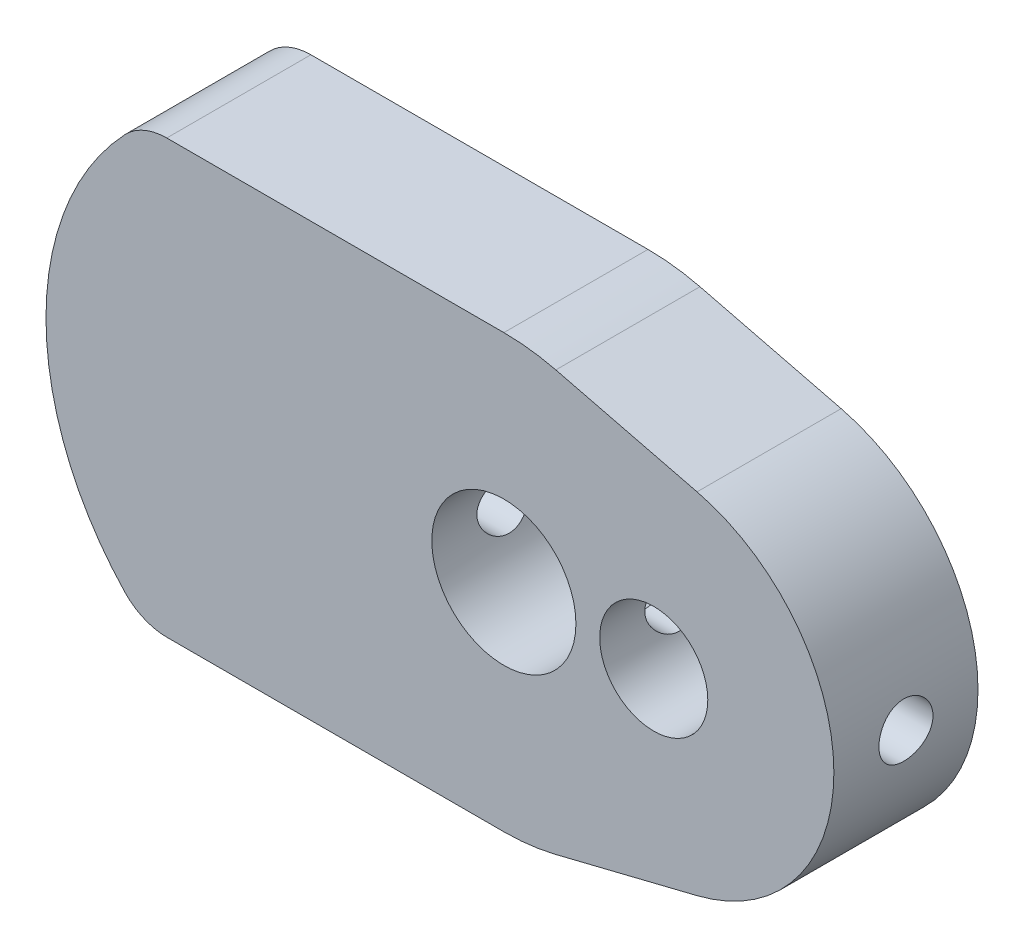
ISO-10303-21;
HEADER;
FILE_DESCRIPTION(('STEP AP214'),'2;1');
FILE_NAME('part.step','',(''),(''),'','','');
FILE_SCHEMA(('AUTOMOTIVE_DESIGN { 1 0 10303 214 1 1 1 1 }'));
ENDSEC;
DATA;
#1=APPLICATION_CONTEXT('core data for automotive mechanical design processes');
#2=APPLICATION_PROTOCOL_DEFINITION('international standard','automotive_design',2000,#1);
#3=PRODUCT_CONTEXT('',#1,'mechanical');
#4=PRODUCT('Part','Part','',(#3));
#5=PRODUCT_RELATED_PRODUCT_CATEGORY('part','',(#4));
#6=PRODUCT_DEFINITION_FORMATION('','',#4);
#7=PRODUCT_DEFINITION_CONTEXT('part definition',#1,'design');
#8=PRODUCT_DEFINITION('design','',#6,#7);
#9=PRODUCT_DEFINITION_SHAPE('','',#8);
#10=(LENGTH_UNIT() NAMED_UNIT(*) SI_UNIT(.MILLI.,.METRE.));
#11=(NAMED_UNIT(*) PLANE_ANGLE_UNIT() SI_UNIT($,.RADIAN.));
#12=(NAMED_UNIT(*) SI_UNIT($,.STERADIAN.) SOLID_ANGLE_UNIT());
#13=UNCERTAINTY_MEASURE_WITH_UNIT(LENGTH_MEASURE(1.E-05),#10,'distance_accuracy_value','');
#14=(GEOMETRIC_REPRESENTATION_CONTEXT(3) GLOBAL_UNCERTAINTY_ASSIGNED_CONTEXT((#13)) GLOBAL_UNIT_ASSIGNED_CONTEXT((#10,
#11,#12)) REPRESENTATION_CONTEXT('',''));
#15=CARTESIAN_POINT('',(0.,0.,0.));
#16=DIRECTION('',(0.,0.,1.));
#17=DIRECTION('',(1.,0.,0.));
#18=AXIS2_PLACEMENT_3D('',#15,#16,#17);
#19=CARTESIAN_POINT('',(0.,0.,3.175));
#20=DIRECTION('',(0.,0.,-1.));
#21=DIRECTION('',(-1.,0.,0.));
#22=AXIS2_PLACEMENT_3D('',#19,#20,#21);
#23=CYLINDRICAL_SURFACE('',#22,9.525);
#24=DIRECTION('',(0.,0.,1.));
#25=VECTOR('',#24,1.);
#26=CARTESIAN_POINT('',(0.,9.52500000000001,-30.9224794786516));
#27=LINE('',#26,#25);
#28=CARTESIAN_POINT('',(0.,9.52500000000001,-3.175));
#29=VERTEX_POINT('',#28);
#30=CARTESIAN_POINT('',(0.,9.52500000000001,3.175));
#31=VERTEX_POINT('',#30);
#32=EDGE_CURVE('E63',#29,#31,#27,.T.);
#33=ORIENTED_EDGE('',*,*,#32,.T.);
#34=CARTESIAN_POINT('',(0.,0.,3.175));
#35=DIRECTION('',(0.,0.,1.));
#36=DIRECTION('',(1.,0.,0.));
#37=AXIS2_PLACEMENT_3D('',#34,#35,#36);
#38=CIRCLE('',#37,9.525);
#39=CARTESIAN_POINT('',(2.28966346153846,9.24570528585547,3.175));
#40=VERTEX_POINT('',#39);
#41=EDGE_CURVE('E182',#40,#31,#38,.T.);
#42=ORIENTED_EDGE('',*,*,#41,.F.);
#43=DIRECTION('',(0.,0.,-1.));
#44=VECTOR('',#43,1.);
#45=CARTESIAN_POINT('',(2.28966346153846,9.24570528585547,3.175));
#46=LINE('',#45,#44);
#47=CARTESIAN_POINT('',(2.28966346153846,9.24570528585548,-3.175));
#48=VERTEX_POINT('',#47);
#49=EDGE_CURVE('E190',#40,#48,#46,.T.);
#50=ORIENTED_EDGE('',*,*,#49,.T.);
#51=CARTESIAN_POINT('',(0.,0.,-3.175));
#52=DIRECTION('',(0.,0.,1.));
#53=DIRECTION('',(1.,0.,0.));
#54=AXIS2_PLACEMENT_3D('',#51,#52,#53);
#55=CIRCLE('',#54,9.525);
#56=EDGE_CURVE('E191',#48,#29,#55,.T.);
#57=ORIENTED_EDGE('',*,*,#56,.T.);
#58=EDGE_LOOP('',(#33,#42,#50,#57));
#59=FACE_BOUND('',#58,.T.);
#60=ADVANCED_FACE('F36',(#59),#23,.T.);
#61=CARTESIAN_POINT('',(0.,0.,3.175));
#62=DIRECTION('',(0.,0.,1.));
#63=DIRECTION('',(1.,0.,0.));
#64=AXIS2_PLACEMENT_3D('',#61,#62,#63);
#65=PLANE('',#64);
#66=CARTESIAN_POINT('',(0.,0.,3.175));
#67=DIRECTION('',(0.,0.,1.));
#68=DIRECTION('',(1.,0.,0.));
#69=AXIS2_PLACEMENT_3D('',#66,#67,#68);
#70=CIRCLE('',#69,3.175);
#71=CARTESIAN_POINT('',(3.175,0.,3.175));
#72=VERTEX_POINT('',#71);
#73=EDGE_CURVE('E176',#72,#72,#70,.T.);
#74=ORIENTED_EDGE('',*,*,#73,.F.);
#75=EDGE_LOOP('',(#74));
#76=FACE_BOUND('',#75,.T.);
#77=ORIENTED_EDGE('',*,*,#41,.T.);
#78=DIRECTION('',(-1.,0.,0.));
#79=VECTOR('',#78,1.);
#80=CARTESIAN_POINT('',(0.,9.52500000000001,3.175));
#81=LINE('',#80,#79);
#82=CARTESIAN_POINT('',(-14.8527728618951,9.52500000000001,3.175));
#83=VERTEX_POINT('',#82);
#84=EDGE_CURVE('E131',#31,#83,#81,.T.);
#85=ORIENTED_EDGE('',*,*,#84,.T.);
#86=CARTESIAN_POINT('',(-14.8527728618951,6.985,3.175));
#87=DIRECTION('',(0.,0.,1.));
#88=DIRECTION('',(1.,0.,0.));
#89=AXIS2_PLACEMENT_3D('',#86,#87,#88);
#90=CIRCLE('',#89,2.54);
#91=CARTESIAN_POINT('',(-16.6972811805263,8.73125,3.175));
#92=VERTEX_POINT('',#91);
#93=EDGE_CURVE('E125',#83,#92,#90,.T.);
#94=ORIENTED_EDGE('',*,*,#93,.T.);
#95=CARTESIAN_POINT('',(-7.47473958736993,0.,3.175));
#96=DIRECTION('',(0.,0.,1.));
#97=DIRECTION('',(1.,0.,0.));
#98=AXIS2_PLACEMENT_3D('',#95,#96,#97);
#99=CIRCLE('',#98,12.7);
#100=CARTESIAN_POINT('',(-16.6972811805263,-8.73125,3.175));
#101=VERTEX_POINT('',#100);
#102=EDGE_CURVE('E134',#92,#101,#99,.T.);
#103=ORIENTED_EDGE('',*,*,#102,.T.);
#104=CARTESIAN_POINT('',(-14.8527728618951,-6.98500000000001,3.175));
#105=DIRECTION('',(0.,0.,1.));
#106=DIRECTION('',(-1.,0.,0.));
#107=AXIS2_PLACEMENT_3D('',#104,#105,#106);
#108=CIRCLE('',#107,2.54);
#109=CARTESIAN_POINT('',(-14.8527728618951,-9.52500000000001,3.175));
#110=VERTEX_POINT('',#109);
#111=EDGE_CURVE('E140',#101,#110,#108,.T.);
#112=ORIENTED_EDGE('',*,*,#111,.T.);
#113=DIRECTION('',(1.,0.,0.));
#114=VECTOR('',#113,1.);
#115=CARTESIAN_POINT('',(0.,-9.52500000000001,3.175));
#116=LINE('',#115,#114);
#117=CARTESIAN_POINT('',(0.,-9.52500000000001,3.175));
#118=VERTEX_POINT('',#117);
#119=EDGE_CURVE('E154',#110,#118,#116,.T.);
#120=ORIENTED_EDGE('',*,*,#119,.T.);
#121=CARTESIAN_POINT('',(2.28966346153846,-9.24570528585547,3.175));
#122=VERTEX_POINT('',#121);
#123=EDGE_CURVE('E55',#118,#122,#38,.T.);
#124=ORIENTED_EDGE('',*,*,#123,.T.);
#125=DIRECTION('',(0.970677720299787,0.240384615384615,0.));
#126=VECTOR('',#125,1.);
#127=CARTESIAN_POINT('',(2.28966346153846,-9.24570528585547,3.175));
#128=LINE('',#127,#126);
#129=CARTESIAN_POINT('',(8.51205288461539,-7.70475440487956,3.175));
#130=VERTEX_POINT('',#129);
#131=EDGE_CURVE('E184',#122,#130,#128,.T.);
#132=ORIENTED_EDGE('',*,*,#131,.T.);
#133=CARTESIAN_POINT('',(6.604,0.,3.175));
#134=DIRECTION('',(0.,0.,1.));
#135=DIRECTION('',(1.,0.,0.));
#136=AXIS2_PLACEMENT_3D('',#133,#134,#135);
#137=CIRCLE('',#136,7.9375);
#138=CARTESIAN_POINT('',(8.51205288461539,7.70475440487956,3.175));
#139=VERTEX_POINT('',#138);
#140=EDGE_CURVE('E186',#130,#139,#137,.T.);
#141=ORIENTED_EDGE('',*,*,#140,.T.);
#142=DIRECTION('',(-0.970677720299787,0.240384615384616,0.));
#143=VECTOR('',#142,1.);
#144=CARTESIAN_POINT('',(2.28966346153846,9.24570528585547,3.175));
#145=LINE('',#144,#143);
#146=EDGE_CURVE('E188',#139,#40,#145,.T.);
#147=ORIENTED_EDGE('',*,*,#146,.T.);
#148=EDGE_LOOP('',(#77,#85,#94,#103,#112,#120,#124,#132,#141,#147));
#149=FACE_BOUND('',#148,.T.);
#150=CARTESIAN_POINT('',(6.604,0.,3.175));
#151=DIRECTION('',(0.,0.,1.));
#152=DIRECTION('',(1.,0.,0.));
#153=AXIS2_PLACEMENT_3D('',#150,#151,#152);
#154=CIRCLE('',#153,2.38125);
#155=CARTESIAN_POINT('',(8.98525000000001,0.,3.175));
#156=VERTEX_POINT('',#155);
#157=EDGE_CURVE('E170',#156,#156,#154,.T.);
#158=ORIENTED_EDGE('',*,*,#157,.F.);
#159=EDGE_LOOP('',(#158));
#160=FACE_BOUND('',#159,.T.);
#161=ADVANCED_FACE('F142',(#76,#149,#160),#65,.T.);
#162=CARTESIAN_POINT('',(0.,0.,-3.175));
#163=DIRECTION('',(0.,0.,1.));
#164=DIRECTION('',(1.,0.,0.));
#165=AXIS2_PLACEMENT_3D('',#162,#163,#164);
#166=PLANE('',#165);
#167=CARTESIAN_POINT('',(0.,0.,-3.175));
#168=DIRECTION('',(0.,0.,1.));
#169=DIRECTION('',(1.,0.,0.));
#170=AXIS2_PLACEMENT_3D('',#167,#168,#169);
#171=CIRCLE('',#170,3.175);
#172=CARTESIAN_POINT('',(3.175,0.,-3.175));
#173=VERTEX_POINT('',#172);
#174=EDGE_CURVE('E173',#173,#173,#171,.T.);
#175=ORIENTED_EDGE('',*,*,#174,.T.);
#176=EDGE_LOOP('',(#175));
#177=FACE_BOUND('',#176,.T.);
#178=ORIENTED_EDGE('',*,*,#56,.F.);
#179=DIRECTION('',(-0.970677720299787,0.240384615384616,0.));
#180=VECTOR('',#179,1.);
#181=CARTESIAN_POINT('',(2.28966346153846,9.24570528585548,-3.175));
#182=LINE('',#181,#180);
#183=CARTESIAN_POINT('',(8.51205288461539,7.70475440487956,-3.175));
#184=VERTEX_POINT('',#183);
#185=EDGE_CURVE('E197',#184,#48,#182,.T.);
#186=ORIENTED_EDGE('',*,*,#185,.F.);
#187=CARTESIAN_POINT('',(6.604,0.,-3.175));
#188=DIRECTION('',(0.,0.,1.));
#189=DIRECTION('',(1.,0.,0.));
#190=AXIS2_PLACEMENT_3D('',#187,#188,#189);
#191=CIRCLE('',#190,7.9375);
#192=CARTESIAN_POINT('',(8.51205288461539,-7.70475440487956,-3.175));
#193=VERTEX_POINT('',#192);
#194=EDGE_CURVE('E195',#193,#184,#191,.T.);
#195=ORIENTED_EDGE('',*,*,#194,.F.);
#196=DIRECTION('',(0.970677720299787,0.240384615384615,0.));
#197=VECTOR('',#196,1.);
#198=CARTESIAN_POINT('',(2.28966346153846,-9.24570528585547,-3.175));
#199=LINE('',#198,#197);
#200=CARTESIAN_POINT('',(2.28966346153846,-9.24570528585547,-3.175));
#201=VERTEX_POINT('',#200);
#202=EDGE_CURVE('E193',#201,#193,#199,.T.);
#203=ORIENTED_EDGE('',*,*,#202,.F.);
#204=CARTESIAN_POINT('',(0.,-9.52500000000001,-3.175));
#205=VERTEX_POINT('',#204);
#206=EDGE_CURVE('E179',#205,#201,#55,.T.);
#207=ORIENTED_EDGE('',*,*,#206,.F.);
#208=DIRECTION('',(-1.,0.,0.));
#209=VECTOR('',#208,1.);
#210=CARTESIAN_POINT('',(0.,-9.52500000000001,-3.175));
#211=LINE('',#210,#209);
#212=CARTESIAN_POINT('',(-14.8527728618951,-9.52500000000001,-3.175));
#213=VERTEX_POINT('',#212);
#214=EDGE_CURVE('E231',#205,#213,#211,.T.);
#215=ORIENTED_EDGE('',*,*,#214,.T.);
#216=CARTESIAN_POINT('',(-14.8527728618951,-6.985,-3.175));
#217=DIRECTION('',(0.,0.,1.));
#218=DIRECTION('',(1.,0.,0.));
#219=AXIS2_PLACEMENT_3D('',#216,#217,#218);
#220=CIRCLE('',#219,2.54);
#221=CARTESIAN_POINT('',(-16.6972811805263,-8.73125,-3.175));
#222=VERTEX_POINT('',#221);
#223=EDGE_CURVE('E160',#213,#222,#220,.F.);
#224=ORIENTED_EDGE('',*,*,#223,.T.);
#225=CARTESIAN_POINT('',(-7.47473958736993,0.,-3.175));
#226=DIRECTION('',(0.,0.,1.));
#227=DIRECTION('',(1.,0.,0.));
#228=AXIS2_PLACEMENT_3D('',#225,#226,#227);
#229=CIRCLE('',#228,12.7);
#230=CARTESIAN_POINT('',(-16.6972811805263,8.73125,-3.175));
#231=VERTEX_POINT('',#230);
#232=EDGE_CURVE('E167',#222,#231,#229,.F.);
#233=ORIENTED_EDGE('',*,*,#232,.T.);
#234=CARTESIAN_POINT('',(-14.8527728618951,6.985,-3.175));
#235=DIRECTION('',(0.,0.,1.));
#236=DIRECTION('',(1.,0.,0.));
#237=AXIS2_PLACEMENT_3D('',#234,#235,#236);
#238=CIRCLE('',#237,2.54);
#239=CARTESIAN_POINT('',(-14.8527728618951,9.52500000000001,-3.175));
#240=VERTEX_POINT('',#239);
#241=EDGE_CURVE('E127',#231,#240,#238,.F.);
#242=ORIENTED_EDGE('',*,*,#241,.T.);
#243=DIRECTION('',(1.,0.,0.));
#244=VECTOR('',#243,1.);
#245=CARTESIAN_POINT('',(0.,9.52500000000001,-3.175));
#246=LINE('',#245,#244);
#247=EDGE_CURVE('E233',#240,#29,#246,.T.);
#248=ORIENTED_EDGE('',*,*,#247,.T.);
#249=EDGE_LOOP('',(#178,#186,#195,#203,#207,#215,#224,#233,#242,#248));
#250=FACE_BOUND('',#249,.T.);
#251=CARTESIAN_POINT('',(6.604,0.,-3.175));
#252=DIRECTION('',(0.,0.,1.));
#253=DIRECTION('',(1.,0.,0.));
#254=AXIS2_PLACEMENT_3D('',#251,#252,#253);
#255=CIRCLE('',#254,2.38125);
#256=CARTESIAN_POINT('',(8.98525000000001,0.,-3.175));
#257=VERTEX_POINT('',#256);
#258=EDGE_CURVE('E169',#257,#257,#255,.T.);
#259=ORIENTED_EDGE('',*,*,#258,.T.);
#260=EDGE_LOOP('',(#259));
#261=FACE_BOUND('',#260,.T.);
#262=ADVANCED_FACE('F216',(#177,#250,#261),#166,.F.);
#263=ORIENTED_EDGE('',*,*,#123,.F.);
#264=DIRECTION('',(0.,0.,1.));
#265=VECTOR('',#264,1.);
#266=CARTESIAN_POINT('',(0.,-9.52500000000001,-30.9224794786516));
#267=LINE('',#266,#265);
#268=EDGE_CURVE('E162',#205,#118,#267,.T.);
#269=ORIENTED_EDGE('',*,*,#268,.F.);
#270=ORIENTED_EDGE('',*,*,#206,.T.);
#271=DIRECTION('',(0.,0.,-1.));
#272=VECTOR('',#271,1.);
#273=CARTESIAN_POINT('',(2.28966346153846,-9.24570528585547,3.175));
#274=LINE('',#273,#272);
#275=EDGE_CURVE('E48',#122,#201,#274,.T.);
#276=ORIENTED_EDGE('',*,*,#275,.F.);
#277=EDGE_LOOP('',(#263,#269,#270,#276));
#278=FACE_BOUND('',#277,.T.);
#279=ADVANCED_FACE('F38',(#278),#23,.T.);
#280=CARTESIAN_POINT('',(2.28966346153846,-9.24570528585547,3.175));
#281=DIRECTION('',(-0.240384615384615,0.970677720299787,0.));
#282=DIRECTION('',(-0.970677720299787,-0.240384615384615,0.));
#283=AXIS2_PLACEMENT_3D('',#280,#281,#282);
#284=PLANE('',#283);
#285=ORIENTED_EDGE('',*,*,#202,.T.);
#286=DIRECTION('',(0.,0.,-1.));
#287=VECTOR('',#286,1.);
#288=CARTESIAN_POINT('',(8.51205288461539,-7.70475440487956,3.175));
#289=LINE('',#288,#287);
#290=EDGE_CURVE('E204',#130,#193,#289,.T.);
#291=ORIENTED_EDGE('',*,*,#290,.F.);
#292=ORIENTED_EDGE('',*,*,#131,.F.);
#293=ORIENTED_EDGE('',*,*,#275,.T.);
#294=EDGE_LOOP('',(#285,#291,#292,#293));
#295=FACE_BOUND('',#294,.T.);
#296=ADVANCED_FACE('F209',(#295),#284,.F.);
#297=CARTESIAN_POINT('',(6.604,0.,3.175));
#298=DIRECTION('',(0.,0.,-1.));
#299=DIRECTION('',(-1.,0.,0.));
#300=AXIS2_PLACEMENT_3D('',#297,#298,#299);
#301=CYLINDRICAL_SURFACE('',#300,7.9375);
#302=CARTESIAN_POINT('',(14.5415,0.,-1.190625));
#303=CARTESIAN_POINT('',(14.5414989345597,-0.0664777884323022,-1.19062225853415));
#304=CARTESIAN_POINT('',(14.5406561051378,-0.132994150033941,-1.18503858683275));
#305=CARTESIAN_POINT('',(14.5373750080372,-0.264167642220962,-1.16285708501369));
#306=CARTESIAN_POINT('',(14.5349351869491,-0.328822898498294,-1.14624853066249));
#307=CARTESIAN_POINT('',(14.52873428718,-0.454356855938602,-1.10252469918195));
#308=CARTESIAN_POINT('',(14.5249742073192,-0.515238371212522,-1.07541736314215));
#309=CARTESIAN_POINT('',(14.5165482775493,-0.631579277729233,-1.01148484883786));
#310=CARTESIAN_POINT('',(14.5118825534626,-0.687039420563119,-0.974661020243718));
#311=CARTESIAN_POINT('',(14.5021234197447,-0.791405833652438,-0.892034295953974));
#312=CARTESIAN_POINT('',(14.4970272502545,-0.840263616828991,-0.846170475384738));
#313=CARTESIAN_POINT('',(14.4870031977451,-0.929620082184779,-0.746896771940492));
#314=CARTESIAN_POINT('',(14.4820753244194,-0.970118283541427,-0.69348645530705));
#315=CARTESIAN_POINT('',(14.4729190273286,-1.0417947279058,-0.580310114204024));
#316=CARTESIAN_POINT('',(14.4686941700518,-1.07292605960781,-0.520514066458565));
#317=CARTESIAN_POINT('',(14.4614599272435,-1.12468526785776,-0.396467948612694));
#318=CARTESIAN_POINT('',(14.4584504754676,-1.14531371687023,-0.332218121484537));
#319=CARTESIAN_POINT('',(14.4540149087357,-1.17533101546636,-0.201598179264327));
#320=CARTESIAN_POINT('',(14.4525771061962,-1.18480287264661,-0.135247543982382));
#321=CARTESIAN_POINT('',(14.451412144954,-1.19249526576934,-0.00188423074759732));
#322=CARTESIAN_POINT('',(14.4516848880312,-1.1907164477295,0.0651284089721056));
#323=CARTESIAN_POINT('',(14.4538995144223,-1.17602582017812,0.197327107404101));
#324=CARTESIAN_POINT('',(14.4558275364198,-1.16320646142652,0.262523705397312));
#325=CARTESIAN_POINT('',(14.461113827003,-1.12694336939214,0.389829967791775));
#326=CARTESIAN_POINT('',(14.4644721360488,-1.10349933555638,0.451939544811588));
#327=CARTESIAN_POINT('',(14.4722559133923,-1.04655622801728,0.571589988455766));
#328=CARTESIAN_POINT('',(14.4766855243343,-1.01301799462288,0.629111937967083));
#329=CARTESIAN_POINT('',(14.486109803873,-0.936866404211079,0.737746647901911));
#330=CARTESIAN_POINT('',(14.4911045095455,-0.894252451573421,0.788858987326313));
#331=CARTESIAN_POINT('',(14.5011574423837,-0.800651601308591,0.883759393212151));
#332=CARTESIAN_POINT('',(14.506215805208,-0.749585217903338,0.927469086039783));
#333=CARTESIAN_POINT('',(14.5157797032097,-0.640800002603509,1.00570977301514));
#334=CARTESIAN_POINT('',(14.5202852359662,-0.583081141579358,1.04024072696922));
#335=CARTESIAN_POINT('',(14.5282405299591,-0.46256146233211,1.09914776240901));
#336=CARTESIAN_POINT('',(14.5316896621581,-0.399757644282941,1.12351779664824));
#337=CARTESIAN_POINT('',(14.5371382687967,-0.270885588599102,1.16134307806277));
#338=CARTESIAN_POINT('',(14.539137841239,-0.204817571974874,1.17479906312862));
#339=CARTESIAN_POINT('',(14.5414490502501,-0.0719689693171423,1.190310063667));
#340=CARTESIAN_POINT('',(14.5417766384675,-0.00520123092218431,1.19247282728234));
#341=CARTESIAN_POINT('',(14.5407503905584,0.127743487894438,1.18562198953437));
#342=CARTESIAN_POINT('',(14.5393966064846,0.193920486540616,1.17660873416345));
#343=CARTESIAN_POINT('',(14.5351695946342,0.32347883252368,1.14775130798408));
#344=CARTESIAN_POINT('',(14.5323037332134,0.386872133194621,1.12795963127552));
#345=CARTESIAN_POINT('',(14.5253728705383,0.50944062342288,1.07816253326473));
#346=CARTESIAN_POINT('',(14.5213078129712,0.568615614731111,1.04815663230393));
#347=CARTESIAN_POINT('',(14.5123906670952,0.681541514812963,0.978530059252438));
#348=CARTESIAN_POINT('',(14.5075330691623,0.73524983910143,0.938841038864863));
#349=CARTESIAN_POINT('',(14.4975886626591,0.835281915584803,0.851070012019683));
#350=CARTESIAN_POINT('',(14.4925018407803,0.881605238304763,0.802987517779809));
#351=CARTESIAN_POINT('',(14.4826217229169,0.965944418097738,0.699314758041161));
#352=CARTESIAN_POINT('',(14.4778312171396,1.00388804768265,0.643665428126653));
#353=CARTESIAN_POINT('',(14.4691355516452,1.06988871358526,0.526719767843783));
#354=CARTESIAN_POINT('',(14.4652303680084,1.09794601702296,0.465423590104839));
#355=CARTESIAN_POINT('',(14.4587676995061,1.1432656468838,0.339139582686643));
#356=CARTESIAN_POINT('',(14.4562054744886,1.16056598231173,0.274165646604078));
#357=CARTESIAN_POINT('',(14.4527062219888,1.18400154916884,0.142193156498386));
#358=CARTESIAN_POINT('',(14.4517690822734,1.19013755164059,0.0751947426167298));
#359=CARTESIAN_POINT('',(14.4516302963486,1.19105193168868,-0.058204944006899));
#360=CARTESIAN_POINT('',(14.4524112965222,1.18594387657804,-0.124605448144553));
#361=CARTESIAN_POINT('',(14.4555830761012,1.16475850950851,-0.255591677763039));
#362=CARTESIAN_POINT('',(14.4579738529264,1.1486812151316,-0.320177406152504));
#363=CARTESIAN_POINT('',(14.4640897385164,1.10605390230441,-0.445669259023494));
#364=CARTESIAN_POINT('',(14.4678138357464,1.07951182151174,-0.50657813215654));
#365=CARTESIAN_POINT('',(14.4761779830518,1.01671967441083,-0.623096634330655));
#366=CARTESIAN_POINT('',(14.4808180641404,0.980469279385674,-0.678706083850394));
#367=CARTESIAN_POINT('',(14.4905471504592,0.898876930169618,-0.783624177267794));
#368=CARTESIAN_POINT('',(14.4956400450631,0.853450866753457,-0.832867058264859));
#369=CARTESIAN_POINT('',(14.5056684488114,0.754974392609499,-0.923071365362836));
#370=CARTESIAN_POINT('',(14.5106039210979,0.70192221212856,-0.964030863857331));
#371=CARTESIAN_POINT('',(14.5197924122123,0.58935596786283,-1.0367070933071));
#372=CARTESIAN_POINT('',(14.524041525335,0.529807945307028,-1.0683717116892));
#373=CARTESIAN_POINT('',(14.5313402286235,0.40620304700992,-1.1212024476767));
#374=CARTESIAN_POINT('',(14.5343910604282,0.34215091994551,-1.14237943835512));
#375=CARTESIAN_POINT('',(14.5382530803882,0.231509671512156,-1.16882969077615));
#376=CARTESIAN_POINT('',(14.5394644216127,0.185603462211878,-1.17699043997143));
#377=CARTESIAN_POINT('',(14.5410882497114,0.0931378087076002,-1.18788902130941));
#378=CARTESIAN_POINT('',(14.5415007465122,0.0465783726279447,-1.19062692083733));
#379=CARTESIAN_POINT('',(14.5415,0.,-1.190625));
#380=B_SPLINE_CURVE_WITH_KNOTS('',3,(#302,#303,#304,#305,#306,#307,#308,#309,#310,#311,#312,
#313,#314,#315,#316,#317,#318,#319,#320,#321,#322,#323,#324,#325,#326,#327,#328,#329,#330,#331,
#332,#333,#334,#335,#336,#337,#338,#339,#340,#341,#342,#343,#344,#345,#346,#347,#348,#349,#350,
#351,#352,#353,#354,#355,#356,#357,#358,#359,#360,#361,#362,#363,#364,#365,#366,#367,#368,#369,
#370,#371,#372,#373,#374,#375,#376,#377,#378,#379),.UNSPECIFIED.,.T.,.F.,(4,2,2,2,2,2,2,2,2,2,2,
2,2,2,2,2,2,2,2,2,2,2,2,2,2,2,2,2,2,2,2,2,2,2,2,2,2,2,4),(0.,0.199263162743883,
0.398720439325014,0.598027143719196,0.797306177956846,0.997977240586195,1.19865984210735,
1.40033138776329,1.60199194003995,1.80214241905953,2.00228140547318,2.20076059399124,
2.39924539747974,2.59851035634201,2.79778839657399,2.99905968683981,3.20033185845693,
3.40172364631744,3.60310181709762,3.80255508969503,4.00200218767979,4.20048649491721,
4.39898012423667,4.59891755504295,4.79886660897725,5.00047709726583,5.2020821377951,
5.40297071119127,5.60384541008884,5.80270055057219,6.00155537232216,6.20025964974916,
6.39897065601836,6.59959333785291,6.80026265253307,7.00203644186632,7.20360060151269,
7.34321820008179,7.48283406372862),.UNSPECIFIED.);
#381=CARTESIAN_POINT('',(14.5415,0.,-1.190625));
#382=VERTEX_POINT('',#381);
#383=EDGE_CURVE('E145',#382,#382,#380,.T.);
#384=ORIENTED_EDGE('',*,*,#383,.T.);
#385=EDGE_LOOP('',(#384));
#386=FACE_BOUND('',#385,.T.);
#387=ORIENTED_EDGE('',*,*,#194,.T.);
#388=DIRECTION('',(0.,0.,-1.));
#389=VECTOR('',#388,1.);
#390=CARTESIAN_POINT('',(8.51205288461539,7.70475440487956,3.175));
#391=LINE('',#390,#389);
#392=EDGE_CURVE('E201',#139,#184,#391,.T.);
#393=ORIENTED_EDGE('',*,*,#392,.F.);
#394=ORIENTED_EDGE('',*,*,#140,.F.);
#395=ORIENTED_EDGE('',*,*,#290,.T.);
#396=EDGE_LOOP('',(#387,#393,#394,#395));
#397=FACE_BOUND('',#396,.T.);
#398=ADVANCED_FACE('F221',(#386,#397),#301,.T.);
#399=CARTESIAN_POINT('',(2.28966346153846,9.24570528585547,3.175));
#400=DIRECTION('',(-0.240384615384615,-0.970677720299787,0.));
#401=DIRECTION('',(0.970677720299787,-0.240384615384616,0.));
#402=AXIS2_PLACEMENT_3D('',#399,#400,#401);
#403=PLANE('',#402);
#404=ORIENTED_EDGE('',*,*,#185,.T.);
#405=ORIENTED_EDGE('',*,*,#49,.F.);
#406=ORIENTED_EDGE('',*,*,#146,.F.);
#407=ORIENTED_EDGE('',*,*,#392,.T.);
#408=EDGE_LOOP('',(#404,#405,#406,#407));
#409=FACE_BOUND('',#408,.T.);
#410=ADVANCED_FACE('F225',(#409),#403,.F.);
#411=CARTESIAN_POINT('',(0.,0.,3.175));
#412=DIRECTION('',(0.,0.,-1.));
#413=DIRECTION('',(-1.,0.,0.));
#414=AXIS2_PLACEMENT_3D('',#411,#412,#413);
#415=CYLINDRICAL_SURFACE('',#414,3.175);
#416=CARTESIAN_POINT('',(-3.175,0.,1.190625));
#417=CARTESIAN_POINT('',(-3.1750017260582,-0.0644803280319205,1.19062730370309));
#418=CARTESIAN_POINT('',(-3.17301863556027,-0.128944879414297,1.18537056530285));
#419=CARTESIAN_POINT('',(-3.16530589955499,-0.255947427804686,1.16456762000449));
#420=CARTESIAN_POINT('',(-3.15957679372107,-0.31848570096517,1.14902289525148));
#421=CARTESIAN_POINT('',(-3.14498698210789,-0.43978574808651,1.10827105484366));
#422=CARTESIAN_POINT('',(-3.13613231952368,-0.498554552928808,1.08308257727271));
#423=CARTESIAN_POINT('',(-3.11617334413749,-0.611028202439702,1.02385303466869));
#424=CARTESIAN_POINT('',(-3.10506842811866,-0.664731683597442,0.989809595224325));
#425=CARTESIAN_POINT('',(-3.08122833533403,-0.767831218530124,0.912326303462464));
#426=CARTESIAN_POINT('',(-3.06844702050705,-0.816983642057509,0.868576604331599));
#427=CARTESIAN_POINT('',(-3.04292175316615,-0.907450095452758,0.773580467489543));
#428=CARTESIAN_POINT('',(-3.03017781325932,-0.94876172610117,0.722331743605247));
#429=CARTESIAN_POINT('',(-3.00563336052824,-1.02392323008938,0.611411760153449));
#430=CARTESIAN_POINT('',(-2.99388727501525,-1.05742893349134,0.551494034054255));
#431=CARTESIAN_POINT('',(-2.97338639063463,-1.1137792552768,0.426364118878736));
#432=CARTESIAN_POINT('',(-2.96463039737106,-1.13662813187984,0.361154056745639));
#433=CARTESIAN_POINT('',(-2.95159440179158,-1.1700544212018,0.230094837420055));
#434=CARTESIAN_POINT('',(-2.94714552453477,-1.1810967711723,0.164381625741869));
#435=CARTESIAN_POINT('',(-2.94273336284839,-1.19205022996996,0.0318959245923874));
#436=CARTESIAN_POINT('',(-2.94276822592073,-1.19196593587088,-0.0348761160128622));
#437=CARTESIAN_POINT('',(-2.94717399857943,-1.18102403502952,-0.163329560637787));
#438=CARTESIAN_POINT('',(-2.95128528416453,-1.17081148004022,-0.225076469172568));
#439=CARTESIAN_POINT('',(-2.96294919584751,-1.14096933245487,-0.345906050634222));
#440=CARTESIAN_POINT('',(-2.97050234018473,-1.12133832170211,-0.404988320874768));
#441=CARTESIAN_POINT('',(-2.98835526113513,-1.07286225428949,-0.520126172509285));
#442=CARTESIAN_POINT('',(-2.99870429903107,-1.04384989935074,-0.576103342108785));
#443=CARTESIAN_POINT('',(-3.02096654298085,-0.977551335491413,-0.682581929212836));
#444=CARTESIAN_POINT('',(-3.03288028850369,-0.940262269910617,-0.733081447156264));
#445=CARTESIAN_POINT('',(-3.05790630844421,-0.855517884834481,-0.830741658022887));
#446=CARTESIAN_POINT('',(-3.07104532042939,-0.807547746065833,-0.8774498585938));
#447=CARTESIAN_POINT('',(-3.09635309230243,-0.704304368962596,-0.962293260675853));
#448=CARTESIAN_POINT('',(-3.108521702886,-0.649030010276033,-1.00042714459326));
#449=CARTESIAN_POINT('',(-3.13075950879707,-0.531592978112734,-1.06753850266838));
#450=CARTESIAN_POINT('',(-3.1407933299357,-0.469337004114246,-1.09636526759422));
#451=CARTESIAN_POINT('',(-3.15736857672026,-0.340389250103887,-1.14298619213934));
#452=CARTESIAN_POINT('',(-3.1639115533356,-0.273699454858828,-1.16078525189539));
#453=CARTESIAN_POINT('',(-3.17249526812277,-0.141585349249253,-1.18397558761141));
#454=CARTESIAN_POINT('',(-3.17475686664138,-0.0762822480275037,-1.18997619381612));
#455=CARTESIAN_POINT('',(-3.17520553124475,0.0544294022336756,-1.19117353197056));
#456=CARTESIAN_POINT('',(-3.17339350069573,0.119837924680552,-1.18637265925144));
#457=CARTESIAN_POINT('',(-3.16604419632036,0.246270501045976,-1.16656640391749));
#458=CARTESIAN_POINT('',(-3.16065273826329,0.307366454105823,-1.15196021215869));
#459=CARTESIAN_POINT('',(-3.1468335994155,0.426197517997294,-1.11348355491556));
#460=CARTESIAN_POINT('',(-3.13840552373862,0.483932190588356,-1.08961188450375));
#461=CARTESIAN_POINT('',(-3.11903764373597,0.596302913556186,-1.03252078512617));
#462=CARTESIAN_POINT('',(-3.1080313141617,0.650798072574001,-0.999047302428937));
#463=CARTESIAN_POINT('',(-3.08472420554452,0.753580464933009,-0.923990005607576));
#464=CARTESIAN_POINT('',(-3.07242294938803,0.801865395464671,-0.882403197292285));
#465=CARTESIAN_POINT('',(-3.04699455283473,0.893786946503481,-0.789460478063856));
#466=CARTESIAN_POINT('',(-3.03386090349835,0.936991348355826,-0.73767776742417));
#467=CARTESIAN_POINT('',(-3.00893809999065,1.01418270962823,-0.627339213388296));
#468=CARTESIAN_POINT('',(-2.99714906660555,1.04816884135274,-0.568782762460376));
#469=CARTESIAN_POINT('',(-2.9762992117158,1.10599357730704,-0.446074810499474));
#470=CARTESIAN_POINT('',(-2.96724991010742,1.12978950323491,-0.38190110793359));
#471=CARTESIAN_POINT('',(-2.95317888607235,1.16608132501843,-0.250023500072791));
#472=CARTESIAN_POINT('',(-2.94815467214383,1.17858421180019,-0.18232180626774));
#473=CARTESIAN_POINT('',(-2.94303366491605,1.1913103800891,-0.0499934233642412));
#474=CARTESIAN_POINT('',(-2.94264115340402,1.19227069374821,0.0145515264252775));
#475=CARTESIAN_POINT('',(-2.94606990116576,1.18377268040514,0.142831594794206));
#476=CARTESIAN_POINT('',(-2.94989076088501,1.17431534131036,0.206566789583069));
#477=CARTESIAN_POINT('',(-2.96106962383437,1.14582428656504,0.329443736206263));
#478=CARTESIAN_POINT('',(-2.96831611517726,1.12709164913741,0.388666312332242));
#479=CARTESIAN_POINT('',(-2.98546478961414,1.08084696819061,0.503162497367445));
#480=CARTESIAN_POINT('',(-2.99536764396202,1.0533327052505,0.558435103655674));
#481=CARTESIAN_POINT('',(-3.01735905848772,0.988632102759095,0.666612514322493));
#482=CARTESIAN_POINT('',(-3.02953498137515,0.951014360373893,0.719241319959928));
#483=CARTESIAN_POINT('',(-3.05439958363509,0.867842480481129,0.817674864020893));
#484=CARTESIAN_POINT('',(-3.06708842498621,0.822285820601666,0.863477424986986));
#485=CARTESIAN_POINT('',(-3.09237399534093,0.721582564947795,0.949485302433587));
#486=CARTESIAN_POINT('',(-3.10492858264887,0.666050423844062,0.989253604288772));
#487=CARTESIAN_POINT('',(-3.12780770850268,0.548650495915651,1.05888048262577));
#488=CARTESIAN_POINT('',(-3.13813207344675,0.486782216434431,1.08873828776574));
#489=CARTESIAN_POINT('',(-3.15574594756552,0.355599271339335,1.13853660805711));
#490=CARTESIAN_POINT('',(-3.16288465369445,0.286078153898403,1.15799160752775));
#491=CARTESIAN_POINT('',(-3.17250954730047,0.144363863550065,1.18403128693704));
#492=CARTESIAN_POINT('',(-3.17499806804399,0.0721720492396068,1.19062242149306));
#493=CARTESIAN_POINT('',(-3.175,0.,1.190625));
#494=B_SPLINE_CURVE_WITH_KNOTS('',3,(#416,#417,#418,#419,#420,#421,#422,#423,#424,#425,#426,
#427,#428,#429,#430,#431,#432,#433,#434,#435,#436,#437,#438,#439,#440,#441,#442,#443,#444,#445,
#446,#447,#448,#449,#450,#451,#452,#453,#454,#455,#456,#457,#458,#459,#460,#461,#462,#463,#464,
#465,#466,#467,#468,#469,#470,#471,#472,#473,#474,#475,#476,#477,#478,#479,#480,#481,#482,#483,
#484,#485,#486,#487,#488,#489,#490,#491,#492,#493),.UNSPECIFIED.,.T.,.F.,(4,2,2,2,2,2,2,2,2,2,2,
2,2,2,2,2,2,2,2,2,2,2,2,2,2,2,2,2,2,2,2,2,2,2,2,2,2,2,4),(0.,0.193174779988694,
0.386321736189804,0.579097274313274,0.771924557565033,0.972134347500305,1.17240530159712,
1.38030485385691,1.58812126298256,1.78741287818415,1.98662215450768,2.17390936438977,
2.36122478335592,2.55208411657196,2.74300942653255,2.94676634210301,3.15055454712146,
3.35749404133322,3.56434151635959,3.76019234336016,3.95599974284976,4.14428335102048,
4.33259145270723,4.52643257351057,4.7203453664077,4.92550862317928,5.13069029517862,
5.33672309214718,5.54262825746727,5.7353101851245,5.92797384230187,6.11475744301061,
6.30158828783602,6.4982127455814,6.69489978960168,6.90223036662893,7.109577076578,
7.32590383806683,7.54212202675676),.UNSPECIFIED.);
#495=CARTESIAN_POINT('',(-3.175,0.,1.190625));
#496=VERTEX_POINT('',#495);
#497=EDGE_CURVE('E148',#496,#496,#494,.T.);
#498=ORIENTED_EDGE('',*,*,#497,.F.);
#499=EDGE_LOOP('',(#498));
#500=FACE_BOUND('',#499,.T.);
#501=CARTESIAN_POINT('',(3.175,0.,-1.190625));
#502=CARTESIAN_POINT('',(3.1750017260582,-0.0644803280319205,-1.19062730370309));
#503=CARTESIAN_POINT('',(3.17301863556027,-0.128944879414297,-1.18537056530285));
#504=CARTESIAN_POINT('',(3.16530589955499,-0.255947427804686,-1.16456762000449));
#505=CARTESIAN_POINT('',(3.15957679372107,-0.31848570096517,-1.14902289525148));
#506=CARTESIAN_POINT('',(3.14498698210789,-0.43978574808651,-1.10827105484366));
#507=CARTESIAN_POINT('',(3.13613231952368,-0.498554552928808,-1.08308257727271));
#508=CARTESIAN_POINT('',(3.11617334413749,-0.611028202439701,-1.02385303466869));
#509=CARTESIAN_POINT('',(3.10506842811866,-0.664731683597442,-0.989809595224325));
#510=CARTESIAN_POINT('',(3.08122833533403,-0.767831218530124,-0.912326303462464));
#511=CARTESIAN_POINT('',(3.06844702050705,-0.816983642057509,-0.868576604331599));
#512=CARTESIAN_POINT('',(3.04292175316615,-0.907450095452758,-0.773580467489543));
#513=CARTESIAN_POINT('',(3.03017781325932,-0.948761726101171,-0.722331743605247));
#514=CARTESIAN_POINT('',(3.00563336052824,-1.02392323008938,-0.611411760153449));
#515=CARTESIAN_POINT('',(2.99388727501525,-1.05742893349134,-0.551494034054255));
#516=CARTESIAN_POINT('',(2.97338639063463,-1.11377925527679,-0.426364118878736));
#517=CARTESIAN_POINT('',(2.96463039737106,-1.13662813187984,-0.361154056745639));
#518=CARTESIAN_POINT('',(2.95159440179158,-1.1700544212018,-0.230094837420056));
#519=CARTESIAN_POINT('',(2.94714552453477,-1.1810967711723,-0.164381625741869));
#520=CARTESIAN_POINT('',(2.94273336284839,-1.19205022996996,-0.0318959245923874));
#521=CARTESIAN_POINT('',(2.94276822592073,-1.19196593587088,0.0348761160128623));
#522=CARTESIAN_POINT('',(2.94717399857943,-1.18102403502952,0.163329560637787));
#523=CARTESIAN_POINT('',(2.95128528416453,-1.17081148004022,0.225076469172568));
#524=CARTESIAN_POINT('',(2.96294919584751,-1.14096933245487,0.345906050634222));
#525=CARTESIAN_POINT('',(2.97050234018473,-1.12133832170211,0.404988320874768));
#526=CARTESIAN_POINT('',(2.98835526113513,-1.07286225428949,0.520126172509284));
#527=CARTESIAN_POINT('',(2.99870429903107,-1.04384989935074,0.576103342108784));
#528=CARTESIAN_POINT('',(3.02096654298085,-0.977551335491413,0.682581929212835));
#529=CARTESIAN_POINT('',(3.03288028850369,-0.940262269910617,0.733081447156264));
#530=CARTESIAN_POINT('',(3.05790630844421,-0.855517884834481,0.830741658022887));
#531=CARTESIAN_POINT('',(3.07104532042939,-0.807547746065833,0.8774498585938));
#532=CARTESIAN_POINT('',(3.09635309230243,-0.704304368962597,0.962293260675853));
#533=CARTESIAN_POINT('',(3.10852170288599,-0.649030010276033,1.00042714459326));
#534=CARTESIAN_POINT('',(3.13075950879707,-0.531592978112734,1.06753850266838));
#535=CARTESIAN_POINT('',(3.1407933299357,-0.469337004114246,1.09636526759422));
#536=CARTESIAN_POINT('',(3.15736857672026,-0.340389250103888,1.14298619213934));
#537=CARTESIAN_POINT('',(3.1639115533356,-0.273699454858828,1.16078525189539));
#538=CARTESIAN_POINT('',(3.17249526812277,-0.141585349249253,1.18397558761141));
#539=CARTESIAN_POINT('',(3.17475686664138,-0.0762822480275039,1.18997619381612));
#540=CARTESIAN_POINT('',(3.17520553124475,0.0544294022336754,1.19117353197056));
#541=CARTESIAN_POINT('',(3.17339350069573,0.119837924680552,1.18637265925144));
#542=CARTESIAN_POINT('',(3.16604419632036,0.246270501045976,1.16656640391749));
#543=CARTESIAN_POINT('',(3.16065273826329,0.307366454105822,1.15196021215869));
#544=CARTESIAN_POINT('',(3.1468335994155,0.426197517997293,1.11348355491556));
#545=CARTESIAN_POINT('',(3.13840552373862,0.483932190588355,1.08961188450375));
#546=CARTESIAN_POINT('',(3.11903764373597,0.596302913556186,1.03252078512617));
#547=CARTESIAN_POINT('',(3.1080313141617,0.650798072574,0.999047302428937));
#548=CARTESIAN_POINT('',(3.08472420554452,0.753580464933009,0.923990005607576));
#549=CARTESIAN_POINT('',(3.07242294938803,0.80186539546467,0.882403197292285));
#550=CARTESIAN_POINT('',(3.04699455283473,0.893786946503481,0.789460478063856));
#551=CARTESIAN_POINT('',(3.03386090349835,0.936991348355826,0.73767776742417));
#552=CARTESIAN_POINT('',(3.00893809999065,1.01418270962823,0.627339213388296));
#553=CARTESIAN_POINT('',(2.99714906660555,1.04816884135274,0.568782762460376));
#554=CARTESIAN_POINT('',(2.9762992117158,1.10599357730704,0.446074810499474));
#555=CARTESIAN_POINT('',(2.96724991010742,1.12978950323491,0.38190110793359));
#556=CARTESIAN_POINT('',(2.95317888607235,1.16608132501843,0.250023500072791));
#557=CARTESIAN_POINT('',(2.94815467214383,1.17858421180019,0.18232180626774));
#558=CARTESIAN_POINT('',(2.94303366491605,1.1913103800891,0.0499934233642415));
#559=CARTESIAN_POINT('',(2.94264115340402,1.19227069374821,-0.0145515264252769));
#560=CARTESIAN_POINT('',(2.94606990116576,1.18377268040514,-0.142831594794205));
#561=CARTESIAN_POINT('',(2.94989076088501,1.17431534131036,-0.206566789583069));
#562=CARTESIAN_POINT('',(2.96106962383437,1.14582428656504,-0.329443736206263));
#563=CARTESIAN_POINT('',(2.96831611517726,1.12709164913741,-0.388666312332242));
#564=CARTESIAN_POINT('',(2.98546478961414,1.08084696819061,-0.503162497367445));
#565=CARTESIAN_POINT('',(2.99536764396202,1.0533327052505,-0.558435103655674));
#566=CARTESIAN_POINT('',(3.01735905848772,0.988632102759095,-0.666612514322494));
#567=CARTESIAN_POINT('',(3.02953498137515,0.951014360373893,-0.719241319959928));
#568=CARTESIAN_POINT('',(3.0543995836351,0.867842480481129,-0.817674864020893));
#569=CARTESIAN_POINT('',(3.06708842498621,0.822285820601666,-0.863477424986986));
#570=CARTESIAN_POINT('',(3.09237399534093,0.721582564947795,-0.949485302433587));
#571=CARTESIAN_POINT('',(3.10492858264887,0.666050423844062,-0.989253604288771));
#572=CARTESIAN_POINT('',(3.12780770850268,0.548650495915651,-1.05888048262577));
#573=CARTESIAN_POINT('',(3.13813207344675,0.486782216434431,-1.08873828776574));
#574=CARTESIAN_POINT('',(3.15574594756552,0.355599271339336,-1.13853660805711));
#575=CARTESIAN_POINT('',(3.16288465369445,0.286078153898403,-1.15799160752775));
#576=CARTESIAN_POINT('',(3.17250954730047,0.144363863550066,-1.18403128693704));
#577=CARTESIAN_POINT('',(3.17499806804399,0.072172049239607,-1.19062242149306));
#578=CARTESIAN_POINT('',(3.175,0.,-1.190625));
#579=B_SPLINE_CURVE_WITH_KNOTS('',3,(#501,#502,#503,#504,#505,#506,#507,#508,#509,#510,#511,
#512,#513,#514,#515,#516,#517,#518,#519,#520,#521,#522,#523,#524,#525,#526,#527,#528,#529,#530,
#531,#532,#533,#534,#535,#536,#537,#538,#539,#540,#541,#542,#543,#544,#545,#546,#547,#548,#549,
#550,#551,#552,#553,#554,#555,#556,#557,#558,#559,#560,#561,#562,#563,#564,#565,#566,#567,#568,
#569,#570,#571,#572,#573,#574,#575,#576,#577,#578),.UNSPECIFIED.,.T.,.F.,(4,2,2,2,2,2,2,2,2,2,2,
2,2,2,2,2,2,2,2,2,2,2,2,2,2,2,2,2,2,2,2,2,2,2,2,2,2,2,4),(0.,0.193174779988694,
0.386321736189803,0.579097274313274,0.771924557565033,0.972134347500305,1.17240530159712,
1.38030485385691,1.58812126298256,1.78741287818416,1.98662215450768,2.17390936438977,
2.36122478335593,2.55208411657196,2.74300942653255,2.94676634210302,3.15055454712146,
3.35749404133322,3.56434151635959,3.76019234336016,3.95599974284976,4.14428335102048,
4.33259145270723,4.52643257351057,4.7203453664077,4.92550862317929,5.13069029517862,
5.33672309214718,5.54262825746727,5.7353101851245,5.92797384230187,6.11475744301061,
6.30158828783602,6.4982127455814,6.69489978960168,6.90223036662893,7.109577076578,
7.32590383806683,7.54212202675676),.UNSPECIFIED.);
#580=CARTESIAN_POINT('',(3.175,0.,-1.190625));
#581=VERTEX_POINT('',#580);
#582=EDGE_CURVE('E270',#581,#581,#579,.T.);
#583=ORIENTED_EDGE('',*,*,#582,.F.);
#584=EDGE_LOOP('',(#583));
#585=FACE_BOUND('',#584,.T.);
#586=ORIENTED_EDGE('',*,*,#73,.T.);
#587=EDGE_LOOP('',(#586));
#588=FACE_BOUND('',#587,.T.);
#589=ORIENTED_EDGE('',*,*,#174,.F.);
#590=EDGE_LOOP('',(#589));
#591=FACE_BOUND('',#590,.T.);
#592=ADVANCED_FACE('F274',(#500,#585,#588,#591),#415,.F.);
#593=CARTESIAN_POINT('',(6.604,0.,3.175));
#594=DIRECTION('',(0.,0.,-1.));
#595=DIRECTION('',(-1.,0.,0.));
#596=AXIS2_PLACEMENT_3D('',#593,#594,#595);
#597=CYLINDRICAL_SURFACE('',#596,2.38125);
#598=CARTESIAN_POINT('',(4.22275,0.,1.190625));
#599=CARTESIAN_POINT('',(4.22275341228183,-0.0625934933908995,1.19062106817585));
#600=CARTESIAN_POINT('',(4.22524446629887,-0.12526160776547,1.18566000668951));
#601=CARTESIAN_POINT('',(4.23496395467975,-0.248745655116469,1.1660351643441));
#602=CARTESIAN_POINT('',(4.24220138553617,-0.309557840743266,1.15135295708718));
#603=CARTESIAN_POINT('',(4.26065617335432,-0.427355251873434,1.11300362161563));
#604=CARTESIAN_POINT('',(4.27185805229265,-0.48435434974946,1.08937141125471));
#605=CARTESIAN_POINT('',(4.29721434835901,-0.593493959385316,1.03397372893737));
#606=CARTESIAN_POINT('',(4.31136853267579,-0.645634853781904,1.00220889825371));
#607=CARTESIAN_POINT('',(4.34233330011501,-0.747126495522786,0.92926227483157));
#608=CARTESIAN_POINT('',(4.35925278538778,-0.796117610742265,0.887627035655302));
#609=CARTESIAN_POINT('',(4.3934859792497,-0.886753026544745,0.797097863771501));
#610=CARTESIAN_POINT('',(4.41079997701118,-0.928391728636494,0.748198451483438));
#611=CARTESIAN_POINT('',(4.44540936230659,-1.00637816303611,0.639980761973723));
#612=CARTESIAN_POINT('',(4.46259918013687,-1.04206516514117,0.580148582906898));
#613=CARTESIAN_POINT('',(4.49318881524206,-1.10271904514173,0.454381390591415));
#614=CARTESIAN_POINT('',(4.50659133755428,-1.12769358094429,0.388450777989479));
#615=CARTESIAN_POINT('',(4.52686102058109,-1.16458893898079,0.256383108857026));
#616=CARTESIAN_POINT('',(4.53407139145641,-1.1772017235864,0.190494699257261));
#617=CARTESIAN_POINT('',(4.54205312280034,-1.19113338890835,0.0571751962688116));
#618=CARTESIAN_POINT('',(4.54283084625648,-1.19246343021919,-0.0102543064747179));
#619=CARTESIAN_POINT('',(4.53813548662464,-1.18429955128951,-0.136071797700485));
#620=CARTESIAN_POINT('',(4.53339878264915,-1.17608099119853,-0.194576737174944));
#621=CARTESIAN_POINT('',(4.5194986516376,-1.15126275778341,-0.309231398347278));
#622=CARTESIAN_POINT('',(4.51033381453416,-1.13466041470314,-0.365380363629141));
#623=CARTESIAN_POINT('',(4.4884084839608,-1.09324351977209,-0.475332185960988));
#624=CARTESIAN_POINT('',(4.47556920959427,-1.06824668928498,-0.52904993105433));
#625=CARTESIAN_POINT('',(4.44773759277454,-1.01089025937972,-0.63178645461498));
#626=CARTESIAN_POINT('',(4.43274428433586,-0.97852735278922,-0.680803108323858));
#627=CARTESIAN_POINT('',(4.39999646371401,-0.90257239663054,-0.779289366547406));
#628=CARTESIAN_POINT('',(4.38213289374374,-0.858076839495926,-0.828028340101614));
#629=CARTESIAN_POINT('',(4.34719861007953,-0.761470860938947,-0.917656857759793));
#630=CARTESIAN_POINT('',(4.33012827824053,-0.709356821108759,-0.958542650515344));
#631=CARTESIAN_POINT('',(4.29773571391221,-0.595927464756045,-1.03308824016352));
#632=CARTESIAN_POINT('',(4.2825314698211,-0.534297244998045,-1.06632431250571));
#633=CARTESIAN_POINT('',(4.25658897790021,-0.405367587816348,-1.12168427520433));
#634=CARTESIAN_POINT('',(4.24584718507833,-0.338072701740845,-1.14381698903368));
#635=CARTESIAN_POINT('',(4.23079465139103,-0.205700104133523,-1.17452227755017));
#636=CARTESIAN_POINT('',(4.22602495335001,-0.140900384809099,-1.18406612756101));
#637=CARTESIAN_POINT('',(4.22188068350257,-0.0104532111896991,-1.192368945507));
#638=CARTESIAN_POINT('',(4.22250355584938,0.0551938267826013,-1.19113302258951));
#639=CARTESIAN_POINT('',(4.22880799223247,0.180061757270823,-1.17847266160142));
#640=CARTESIAN_POINT('',(4.23409373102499,0.239386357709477,-1.16784532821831));
#641=CARTESIAN_POINT('',(4.24867977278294,0.35529070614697,-1.13795404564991));
#642=CARTESIAN_POINT('',(4.25798051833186,0.411870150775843,-1.11868914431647));
#643=CARTESIAN_POINT('',(4.280087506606,0.522551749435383,-1.071564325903));
#644=CARTESIAN_POINT('',(4.29298637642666,0.576536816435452,-1.04347440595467));
#645=CARTESIAN_POINT('',(4.32104830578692,0.679205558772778,-0.979756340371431));
#646=CARTESIAN_POINT('',(4.33621232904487,0.727886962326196,-0.944124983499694));
#647=CARTESIAN_POINT('',(4.36909898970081,0.823635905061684,-0.862297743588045));
#648=CARTESIAN_POINT('',(4.38692665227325,0.87007550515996,-0.815408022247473));
#649=CARTESIAN_POINT('',(4.42203214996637,0.954710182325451,-0.714464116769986));
#650=CARTESIAN_POINT('',(4.4393095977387,0.992899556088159,-0.660405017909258));
#651=CARTESIAN_POINT('',(4.47217174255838,1.06168973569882,-0.543349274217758));
#652=CARTESIAN_POINT('',(4.48763394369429,1.0918334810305,-0.480046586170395));
#653=CARTESIAN_POINT('',(4.513571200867,1.14071736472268,-0.348245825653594));
#654=CARTESIAN_POINT('',(4.52405267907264,1.15947219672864,-0.279754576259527));
#655=CARTESIAN_POINT('',(4.53753337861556,1.18331657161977,-0.14655376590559));
#656=CARTESIAN_POINT('',(4.54115427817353,1.18954509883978,-0.0821123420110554));
#657=CARTESIAN_POINT('',(4.54224999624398,1.19144552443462,0.0469666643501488));
#658=CARTESIAN_POINT('',(4.53972747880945,1.18712199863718,0.111604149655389));
#659=CARTESIAN_POINT('',(4.52948045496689,1.16910579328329,0.232747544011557));
#660=CARTESIAN_POINT('',(4.522274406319,1.15634489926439,0.289441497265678));
#661=CARTESIAN_POINT('',(4.50408258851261,1.12296816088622,0.399821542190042));
#662=CARTESIAN_POINT('',(4.49309560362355,1.10234978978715,0.453506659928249));
#663=CARTESIAN_POINT('',(4.46767906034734,1.05229312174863,0.560337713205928));
#664=CARTESIAN_POINT('',(4.45306780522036,1.02235532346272,0.613205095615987));
#665=CARTESIAN_POINT('',(4.42235433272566,0.955061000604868,0.713511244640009));
#666=CARTESIAN_POINT('',(4.40625134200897,0.917700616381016,0.760947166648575));
#667=CARTESIAN_POINT('',(4.37202671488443,0.831298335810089,0.855037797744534));
#668=CARTESIAN_POINT('',(4.35389754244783,0.781388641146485,0.900897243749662));
#669=CARTESIAN_POINT('',(4.31945551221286,0.674078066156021,0.983769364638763));
#670=CARTESIAN_POINT('',(4.30314363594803,0.616673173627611,1.02077727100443));
#671=CARTESIAN_POINT('',(4.27397057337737,0.49521855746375,1.08494079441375));
#672=CARTESIAN_POINT('',(4.26113460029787,0.43112472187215,1.11202490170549));
#673=CARTESIAN_POINT('',(4.24059340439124,0.298539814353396,1.1546778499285));
#674=CARTESIAN_POINT('',(4.23287360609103,0.230061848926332,1.17027941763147));
#675=CARTESIAN_POINT('',(4.22637590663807,0.134066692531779,1.18335910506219));
#676=CARTESIAN_POINT('',(4.22501974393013,0.107348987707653,1.18607995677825));
#677=CARTESIAN_POINT('',(4.2232060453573,0.0537587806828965,1.18971377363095));
#678=CARTESIAN_POINT('',(4.22274853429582,0.0268862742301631,1.19062668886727));
#679=CARTESIAN_POINT('',(4.22275,0.,1.190625));
#680=B_SPLINE_CURVE_WITH_KNOTS('',3,(#598,#599,#600,#601,#602,#603,#604,#605,#606,#607,#608,
#609,#610,#611,#612,#613,#614,#615,#616,#617,#618,#619,#620,#621,#622,#623,#624,#625,#626,#627,
#628,#629,#630,#631,#632,#633,#634,#635,#636,#637,#638,#639,#640,#641,#642,#643,#644,#645,#646,
#647,#648,#649,#650,#651,#652,#653,#654,#655,#656,#657,#658,#659,#660,#661,#662,#663,#664,#665,
#666,#667,#668,#669,#670,#671,#672,#673,#674,#675,#676,#677,#678,#679),.UNSPECIFIED.,.T.,.F.,(4,
2,2,2,2,2,2,2,2,2,2,2,2,2,2,2,2,2,2,2,2,2,2,2,2,2,2,2,2,2,2,2,2,2,2,2,2,2,2,2,4),(0.,
0.187671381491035,0.375699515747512,0.563001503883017,0.750288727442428,0.948906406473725,
1.14767467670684,1.36185743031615,1.57588681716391,1.77710320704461,1.97812053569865,
2.15509926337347,2.33213438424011,2.51329317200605,2.69453345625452,2.89875445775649,
3.10307277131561,3.31687910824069,3.53051527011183,3.72645730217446,3.92230647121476,
4.10297598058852,4.28366541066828,4.46952119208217,4.65545627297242,4.85965036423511,
5.06398516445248,5.27821543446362,5.49216872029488,5.68558331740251,5.87891405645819,
6.0538272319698,6.22879670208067,6.41552156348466,6.60234377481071,6.81186617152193,
7.02150118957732,7.2326184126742,7.44313156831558,7.52374130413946,7.6043532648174),.UNSPECIFIED.);
#681=CARTESIAN_POINT('',(4.22275,0.,1.190625));
#682=VERTEX_POINT('',#681);
#683=EDGE_CURVE('E267',#682,#682,#680,.T.);
#684=ORIENTED_EDGE('',*,*,#683,.F.);
#685=EDGE_LOOP('',(#684));
#686=FACE_BOUND('',#685,.T.);
#687=CARTESIAN_POINT('',(8.98525000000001,0.,-1.190625));
#688=CARTESIAN_POINT('',(8.98524658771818,-0.0625934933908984,-1.19062106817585));
#689=CARTESIAN_POINT('',(8.98275553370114,-0.125261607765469,-1.18566000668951));
#690=CARTESIAN_POINT('',(8.97303604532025,-0.248745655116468,-1.1660351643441));
#691=CARTESIAN_POINT('',(8.96579861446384,-0.309557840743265,-1.15135295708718));
#692=CARTESIAN_POINT('',(8.94734382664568,-0.427355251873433,-1.11300362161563));
#693=CARTESIAN_POINT('',(8.93614194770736,-0.484354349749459,-1.08937141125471));
#694=CARTESIAN_POINT('',(8.91078565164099,-0.593493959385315,-1.03397372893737));
#695=CARTESIAN_POINT('',(8.89663146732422,-0.645634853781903,-1.00220889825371));
#696=CARTESIAN_POINT('',(8.865666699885,-0.747126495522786,-0.92926227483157));
#697=CARTESIAN_POINT('',(8.84874721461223,-0.796117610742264,-0.887627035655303));
#698=CARTESIAN_POINT('',(8.8145140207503,-0.886753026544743,-0.797097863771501));
#699=CARTESIAN_POINT('',(8.79720002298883,-0.928391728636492,-0.748198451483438));
#700=CARTESIAN_POINT('',(8.76259063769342,-1.00637816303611,-0.639980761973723));
#701=CARTESIAN_POINT('',(8.74540081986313,-1.04206516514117,-0.580148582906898));
#702=CARTESIAN_POINT('',(8.71481118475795,-1.10271904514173,-0.454381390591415));
#703=CARTESIAN_POINT('',(8.70140866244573,-1.12769358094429,-0.388450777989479));
#704=CARTESIAN_POINT('',(8.68113897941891,-1.16458893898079,-0.256383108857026));
#705=CARTESIAN_POINT('',(8.67392860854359,-1.1772017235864,-0.190494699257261));
#706=CARTESIAN_POINT('',(8.66594687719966,-1.19113338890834,-0.057175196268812));
#707=CARTESIAN_POINT('',(8.66516915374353,-1.19246343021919,0.0102543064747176));
#708=CARTESIAN_POINT('',(8.66986451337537,-1.18429955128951,0.136071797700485));
#709=CARTESIAN_POINT('',(8.67460121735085,-1.17608099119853,0.194576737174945));
#710=CARTESIAN_POINT('',(8.68850134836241,-1.15126275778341,0.309231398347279));
#711=CARTESIAN_POINT('',(8.69766618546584,-1.13466041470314,0.365380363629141));
#712=CARTESIAN_POINT('',(8.7195915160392,-1.09324351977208,0.475332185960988));
#713=CARTESIAN_POINT('',(8.73243079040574,-1.06824668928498,0.529049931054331));
#714=CARTESIAN_POINT('',(8.76026240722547,-1.01089025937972,0.631786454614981));
#715=CARTESIAN_POINT('',(8.77525571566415,-0.978527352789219,0.680803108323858));
#716=CARTESIAN_POINT('',(8.80800353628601,-0.902572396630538,0.779289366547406));
#717=CARTESIAN_POINT('',(8.82586710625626,-0.858076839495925,0.828028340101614));
#718=CARTESIAN_POINT('',(8.86080138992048,-0.761470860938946,0.917656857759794));
#719=CARTESIAN_POINT('',(8.87787172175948,-0.709356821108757,0.958542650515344));
#720=CARTESIAN_POINT('',(8.91026428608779,-0.595927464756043,1.03308824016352));
#721=CARTESIAN_POINT('',(8.9254685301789,-0.534297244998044,1.06632431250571));
#722=CARTESIAN_POINT('',(8.95141102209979,-0.405367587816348,1.12168427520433));
#723=CARTESIAN_POINT('',(8.96215281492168,-0.338072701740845,1.14381698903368));
#724=CARTESIAN_POINT('',(8.97720534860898,-0.205700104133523,1.17452227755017));
#725=CARTESIAN_POINT('',(8.98197504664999,-0.140900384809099,1.18406612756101));
#726=CARTESIAN_POINT('',(8.98611931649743,-0.010453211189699,1.192368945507));
#727=CARTESIAN_POINT('',(8.98549644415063,0.0551938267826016,1.19113302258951));
#728=CARTESIAN_POINT('',(8.97919200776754,0.180061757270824,1.17847266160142));
#729=CARTESIAN_POINT('',(8.97390626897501,0.239386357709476,1.16784532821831));
#730=CARTESIAN_POINT('',(8.95932022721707,0.35529070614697,1.13795404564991));
#731=CARTESIAN_POINT('',(8.95001948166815,0.411870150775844,1.11868914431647));
#732=CARTESIAN_POINT('',(8.92791249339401,0.522551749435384,1.071564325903));
#733=CARTESIAN_POINT('',(8.91501362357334,0.576536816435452,1.04347440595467));
#734=CARTESIAN_POINT('',(8.88695169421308,0.679205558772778,0.979756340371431));
#735=CARTESIAN_POINT('',(8.87178767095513,0.727886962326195,0.944124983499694));
#736=CARTESIAN_POINT('',(8.83890101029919,0.823635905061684,0.862297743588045));
#737=CARTESIAN_POINT('',(8.82107334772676,0.870075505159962,0.815408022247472));
#738=CARTESIAN_POINT('',(8.78596785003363,0.954710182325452,0.714464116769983));
#739=CARTESIAN_POINT('',(8.7686904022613,0.992899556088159,0.660405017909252));
#740=CARTESIAN_POINT('',(8.73582825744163,1.06168973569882,0.543349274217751));
#741=CARTESIAN_POINT('',(8.72036605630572,1.0918334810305,0.48004658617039));
#742=CARTESIAN_POINT('',(8.69442879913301,1.14071736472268,0.348245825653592));
#743=CARTESIAN_POINT('',(8.68394732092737,1.15947219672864,0.279754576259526));
#744=CARTESIAN_POINT('',(8.67046662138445,1.18331657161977,0.146553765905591));
#745=CARTESIAN_POINT('',(8.66684572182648,1.18954509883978,0.082112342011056));
#746=CARTESIAN_POINT('',(8.66575000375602,1.19144552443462,-0.046966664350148));
#747=CARTESIAN_POINT('',(8.66827252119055,1.18712199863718,-0.111604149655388));
#748=CARTESIAN_POINT('',(8.67851954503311,1.16910579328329,-0.232747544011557));
#749=CARTESIAN_POINT('',(8.685725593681,1.15634489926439,-0.289441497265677));
#750=CARTESIAN_POINT('',(8.7039174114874,1.12296816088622,-0.399821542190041));
#751=CARTESIAN_POINT('',(8.71490439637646,1.10234978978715,-0.453506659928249));
#752=CARTESIAN_POINT('',(8.74032093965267,1.05229312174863,-0.560337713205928));
#753=CARTESIAN_POINT('',(8.75493219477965,1.02235532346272,-0.613205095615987));
#754=CARTESIAN_POINT('',(8.78564566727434,0.955061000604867,-0.713511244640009));
#755=CARTESIAN_POINT('',(8.80174865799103,0.917700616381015,-0.760947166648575));
#756=CARTESIAN_POINT('',(8.83597328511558,0.831298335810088,-0.855037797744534));
#757=CARTESIAN_POINT('',(8.85410245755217,0.781388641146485,-0.900897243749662));
#758=CARTESIAN_POINT('',(8.88854448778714,0.674078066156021,-0.983769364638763));
#759=CARTESIAN_POINT('',(8.90485636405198,0.616673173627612,-1.02077727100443));
#760=CARTESIAN_POINT('',(8.93402942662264,0.495218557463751,-1.08494079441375));
#761=CARTESIAN_POINT('',(8.94686539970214,0.431124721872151,-1.11202490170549));
#762=CARTESIAN_POINT('',(8.96740659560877,0.298539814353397,-1.1546778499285));
#763=CARTESIAN_POINT('',(8.97512639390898,0.230061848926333,-1.17027941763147));
#764=CARTESIAN_POINT('',(8.98162409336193,0.13406669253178,-1.18335910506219));
#765=CARTESIAN_POINT('',(8.98298025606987,0.107348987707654,-1.18607995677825));
#766=CARTESIAN_POINT('',(8.98479395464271,0.0537587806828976,-1.18971377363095));
#767=CARTESIAN_POINT('',(8.98525146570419,0.0268862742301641,-1.19062668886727));
#768=CARTESIAN_POINT('',(8.98525000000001,0.,-1.190625));
#769=B_SPLINE_CURVE_WITH_KNOTS('',3,(#687,#688,#689,#690,#691,#692,#693,#694,#695,#696,#697,
#698,#699,#700,#701,#702,#703,#704,#705,#706,#707,#708,#709,#710,#711,#712,#713,#714,#715,#716,
#717,#718,#719,#720,#721,#722,#723,#724,#725,#726,#727,#728,#729,#730,#731,#732,#733,#734,#735,
#736,#737,#738,#739,#740,#741,#742,#743,#744,#745,#746,#747,#748,#749,#750,#751,#752,#753,#754,
#755,#756,#757,#758,#759,#760,#761,#762,#763,#764,#765,#766,#767,#768),.UNSPECIFIED.,.T.,.F.,(4,
2,2,2,2,2,2,2,2,2,2,2,2,2,2,2,2,2,2,2,2,2,2,2,2,2,2,2,2,2,2,2,2,2,2,2,2,2,2,2,4),(0.,
0.187671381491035,0.375699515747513,0.563001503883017,0.750288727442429,0.948906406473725,
1.14767467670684,1.36185743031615,1.57588681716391,1.77710320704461,1.97812053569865,
2.15509926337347,2.33213438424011,2.51329317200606,2.69453345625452,2.89875445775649,
3.10307277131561,3.31687910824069,3.53051527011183,3.72645730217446,3.92230647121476,
4.10297598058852,4.28366541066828,4.46952119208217,4.65545627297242,4.85965036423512,
5.06398516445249,5.27821543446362,5.49216872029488,5.68558331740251,5.87891405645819,
6.0538272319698,6.22879670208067,6.41552156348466,6.60234377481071,6.81186617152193,
7.02150118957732,7.2326184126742,7.44313156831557,7.52374130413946,7.6043532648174),.UNSPECIFIED.);
#770=CARTESIAN_POINT('',(8.98525000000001,0.,-1.190625));
#771=VERTEX_POINT('',#770);
#772=EDGE_CURVE('E261',#771,#771,#769,.T.);
#773=ORIENTED_EDGE('',*,*,#772,.F.);
#774=EDGE_LOOP('',(#773));
#775=FACE_BOUND('',#774,.T.);
#776=ORIENTED_EDGE('',*,*,#157,.T.);
#777=EDGE_LOOP('',(#776));
#778=FACE_BOUND('',#777,.T.);
#779=ORIENTED_EDGE('',*,*,#258,.F.);
#780=EDGE_LOOP('',(#779));
#781=FACE_BOUND('',#780,.T.);
#782=ADVANCED_FACE('F278',(#686,#775,#778,#781),#597,.F.);
#783=CARTESIAN_POINT('',(-14.8527728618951,6.98500000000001,-30.9224794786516));
#784=DIRECTION('',(0.,0.,1.));
#785=DIRECTION('',(1.,0.,0.));
#786=AXIS2_PLACEMENT_3D('',#783,#784,#785);
#787=CYLINDRICAL_SURFACE('',#786,2.54);
#788=ORIENTED_EDGE('',*,*,#241,.F.);
#789=DIRECTION('',(0.,0.,1.));
#790=VECTOR('',#789,1.);
#791=CARTESIAN_POINT('',(-16.6972811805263,8.73125000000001,-30.9224794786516));
#792=LINE('',#791,#790);
#793=EDGE_CURVE('E120',#231,#92,#792,.T.);
#794=ORIENTED_EDGE('',*,*,#793,.T.);
#795=ORIENTED_EDGE('',*,*,#93,.F.);
#796=DIRECTION('',(0.,0.,1.));
#797=VECTOR('',#796,1.);
#798=CARTESIAN_POINT('',(-14.8527728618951,9.52500000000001,-30.9224794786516));
#799=LINE('',#798,#797);
#800=EDGE_CURVE('E158',#240,#83,#799,.T.);
#801=ORIENTED_EDGE('',*,*,#800,.F.);
#802=EDGE_LOOP('',(#788,#794,#795,#801));
#803=FACE_BOUND('',#802,.T.);
#804=ADVANCED_FACE('F122',(#803),#787,.T.);
#805=CARTESIAN_POINT('',(0.,9.52500000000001,-30.9224794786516));
#806=DIRECTION('',(0.,1.,0.));
#807=DIRECTION('',(-1.,0.,0.));
#808=AXIS2_PLACEMENT_3D('',#805,#806,#807);
#809=PLANE('',#808);
#810=ORIENTED_EDGE('',*,*,#247,.F.);
#811=ORIENTED_EDGE('',*,*,#800,.T.);
#812=ORIENTED_EDGE('',*,*,#84,.F.);
#813=ORIENTED_EDGE('',*,*,#32,.F.);
#814=EDGE_LOOP('',(#810,#811,#812,#813));
#815=FACE_BOUND('',#814,.T.);
#816=ADVANCED_FACE('F254',(#815),#809,.T.);
#817=CARTESIAN_POINT('',(0.,-9.525,-30.9224794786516));
#818=DIRECTION('',(0.,-1.,0.));
#819=DIRECTION('',(1.,0.,0.));
#820=AXIS2_PLACEMENT_3D('',#817,#818,#819);
#821=PLANE('',#820);
#822=ORIENTED_EDGE('',*,*,#214,.F.);
#823=ORIENTED_EDGE('',*,*,#268,.T.);
#824=ORIENTED_EDGE('',*,*,#119,.F.);
#825=DIRECTION('',(0.,0.,1.));
#826=VECTOR('',#825,1.);
#827=CARTESIAN_POINT('',(-14.8527728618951,-9.52500000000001,-30.9224794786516));
#828=LINE('',#827,#826);
#829=EDGE_CURVE('E164',#213,#110,#828,.T.);
#830=ORIENTED_EDGE('',*,*,#829,.F.);
#831=EDGE_LOOP('',(#822,#823,#824,#830));
#832=FACE_BOUND('',#831,.T.);
#833=ADVANCED_FACE('F230',(#832),#821,.T.);
#834=CARTESIAN_POINT('',(-14.8527728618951,-6.985,-30.9224794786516));
#835=DIRECTION('',(0.,0.,1.));
#836=DIRECTION('',(1.,0.,0.));
#837=AXIS2_PLACEMENT_3D('',#834,#835,#836);
#838=CYLINDRICAL_SURFACE('',#837,2.54);
#839=ORIENTED_EDGE('',*,*,#223,.F.);
#840=ORIENTED_EDGE('',*,*,#829,.T.);
#841=ORIENTED_EDGE('',*,*,#111,.F.);
#842=DIRECTION('',(0.,0.,1.));
#843=VECTOR('',#842,1.);
#844=CARTESIAN_POINT('',(-16.6972811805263,-8.73125,-30.9224794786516));
#845=LINE('',#844,#843);
#846=EDGE_CURVE('E130',#222,#101,#845,.T.);
#847=ORIENTED_EDGE('',*,*,#846,.F.);
#848=EDGE_LOOP('',(#839,#840,#841,#847));
#849=FACE_BOUND('',#848,.T.);
#850=ADVANCED_FACE('F350',(#849),#838,.T.);
#851=CARTESIAN_POINT('',(-7.47473958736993,0.,-30.9224794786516));
#852=DIRECTION('',(0.,0.,1.));
#853=DIRECTION('',(1.,0.,0.));
#854=AXIS2_PLACEMENT_3D('',#851,#852,#853);
#855=CYLINDRICAL_SURFACE('',#854,12.7);
#856=CARTESIAN_POINT('',(-20.1747395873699,0.,-1.190625));
#857=CARTESIAN_POINT('',(-20.1747388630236,-0.0667207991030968,-1.19062210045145));
#858=CARTESIAN_POINT('',(-20.1742082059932,-0.133486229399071,-1.18499772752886));
#859=CARTESIAN_POINT('',(-20.1721423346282,-0.265167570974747,-1.16264507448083));
#860=CARTESIAN_POINT('',(-20.1706060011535,-0.330081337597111,-1.14590442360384));
#861=CARTESIAN_POINT('',(-20.1667022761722,-0.456133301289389,-1.10180955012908));
#862=CARTESIAN_POINT('',(-20.1643353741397,-0.517273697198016,-1.07446157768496));
#863=CARTESIAN_POINT('',(-20.1590354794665,-0.634082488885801,-1.00994013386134));
#864=CARTESIAN_POINT('',(-20.1561026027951,-0.689752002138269,-0.97276867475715));
#865=CARTESIAN_POINT('',(-20.1499890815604,-0.794229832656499,-0.889528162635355));
#866=CARTESIAN_POINT('',(-20.1468077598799,-0.843018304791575,-0.843434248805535));
#867=CARTESIAN_POINT('',(-20.1405615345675,-0.932178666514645,-0.743710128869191));
#868=CARTESIAN_POINT('',(-20.1374966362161,-0.972550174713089,-0.690079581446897));
#869=CARTESIAN_POINT('',(-20.1318232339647,-1.04379978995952,-0.576681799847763));
#870=CARTESIAN_POINT('',(-20.1292155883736,-1.07466012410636,-0.516903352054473));
#871=CARTESIAN_POINT('',(-20.1247601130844,-1.12589788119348,-0.392984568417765));
#872=CARTESIAN_POINT('',(-20.1229122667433,-1.14627553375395,-0.328844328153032));
#873=CARTESIAN_POINT('',(-20.1201915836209,-1.1759110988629,-0.198223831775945));
#874=CARTESIAN_POINT('',(-20.1193158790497,-1.18520172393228,-0.131751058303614));
#875=CARTESIAN_POINT('',(-20.1186296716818,-1.19250060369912,0.0018156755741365));
#876=CARTESIAN_POINT('',(-20.1188191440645,-1.19050912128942,0.0689096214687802));
#877=CARTESIAN_POINT('',(-20.1202392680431,-1.17532730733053,0.201589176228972));
#878=CARTESIAN_POINT('',(-20.1214666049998,-1.16217262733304,0.267178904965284));
#879=CARTESIAN_POINT('',(-20.1248189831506,-1.12509327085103,0.395215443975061));
#880=CARTESIAN_POINT('',(-20.1269440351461,-1.10116846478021,0.457662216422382));
#881=CARTESIAN_POINT('',(-20.1318562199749,-1.04318841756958,0.577753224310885));
#882=CARTESIAN_POINT('',(-20.134644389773,-1.00911728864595,0.635389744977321));
#883=CARTESIAN_POINT('',(-20.140567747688,-0.931823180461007,0.744139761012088));
#884=CARTESIAN_POINT('',(-20.1437029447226,-0.888599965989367,0.795253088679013));
#885=CARTESIAN_POINT('',(-20.1499818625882,-0.794029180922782,0.889713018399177));
#886=CARTESIAN_POINT('',(-20.1531255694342,-0.742650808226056,0.933028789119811));
#887=CARTESIAN_POINT('',(-20.1590557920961,-0.633335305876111,1.01042529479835));
#888=CARTESIAN_POINT('',(-20.1618423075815,-0.575398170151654,1.04450602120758));
#889=CARTESIAN_POINT('',(-20.1667449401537,-0.454588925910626,1.10246350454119));
#890=CARTESIAN_POINT('',(-20.1688609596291,-0.391716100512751,1.12633877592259));
#891=CARTESIAN_POINT('',(-20.172183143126,-0.262829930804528,1.16318542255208));
#892=CARTESIAN_POINT('',(-20.1733893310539,-0.196816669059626,1.17615708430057));
#893=CARTESIAN_POINT('',(-20.1747528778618,-0.0637905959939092,1.19078936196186));
#894=CARTESIAN_POINT('',(-20.1749141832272,0.00321749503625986,1.19249253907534));
#895=CARTESIAN_POINT('',(-20.1741803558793,0.136565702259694,1.18465117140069));
#896=CARTESIAN_POINT('',(-20.173285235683,0.202905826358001,1.1751067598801));
#897=CARTESIAN_POINT('',(-20.1705417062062,0.332912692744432,1.14507644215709));
#898=CARTESIAN_POINT('',(-20.1686950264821,0.396584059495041,1.12461038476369));
#899=CARTESIAN_POINT('',(-20.1642556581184,0.51958956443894,1.07333807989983));
#900=CARTESIAN_POINT('',(-20.1616629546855,0.578923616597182,1.04253162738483));
#901=CARTESIAN_POINT('',(-20.1560119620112,0.691763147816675,0.971346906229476));
#902=CARTESIAN_POINT('',(-20.1529523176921,0.74525085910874,0.930940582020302));
#903=CARTESIAN_POINT('',(-20.1467153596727,0.844699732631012,0.841743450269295));
#904=CARTESIAN_POINT('',(-20.1435380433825,0.890660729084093,0.79295245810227));
#905=CARTESIAN_POINT('',(-20.1374120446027,0.973898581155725,0.688185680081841));
#906=CARTESIAN_POINT('',(-20.1344641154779,1.01114756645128,0.63218770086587));
#907=CARTESIAN_POINT('',(-20.1291418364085,1.07571263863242,0.514706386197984));
#908=CARTESIAN_POINT('',(-20.1267674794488,1.10302884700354,0.453223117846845));
#909=CARTESIAN_POINT('',(-20.1228657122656,1.14690597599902,0.326613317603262));
#910=CARTESIAN_POINT('',(-20.1213369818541,1.16348366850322,0.261492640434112));
#911=CARTESIAN_POINT('',(-20.1192953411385,1.18546768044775,0.129377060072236));
#912=CARTESIAN_POINT('',(-20.1187824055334,1.19087427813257,0.062382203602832));
#913=CARTESIAN_POINT('',(-20.1188309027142,1.19035902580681,-0.0713030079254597));
#914=CARTESIAN_POINT('',(-20.119388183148,1.18448095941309,-0.137993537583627));
#915=CARTESIAN_POINT('',(-20.1215054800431,1.16165483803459,-0.269435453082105));
#916=CARTESIAN_POINT('',(-20.1230654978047,1.14470676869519,-0.334186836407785));
#917=CARTESIAN_POINT('',(-20.1270113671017,1.10023343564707,-0.459913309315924));
#918=CARTESIAN_POINT('',(-20.1293971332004,1.07270926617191,-0.520888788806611));
#919=CARTESIAN_POINT('',(-20.1347258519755,1.00786968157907,-0.637361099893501));
#920=CARTESIAN_POINT('',(-20.1376687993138,0.970554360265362,-0.692857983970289));
#921=CARTESIAN_POINT('',(-20.1437939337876,0.887027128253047,-0.797022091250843));
#922=CARTESIAN_POINT('',(-20.1469769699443,0.840782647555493,-0.84566314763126));
#923=CARTESIAN_POINT('',(-20.1532158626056,0.740772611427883,-0.934515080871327));
#924=CARTESIAN_POINT('',(-20.1562716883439,0.687005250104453,-0.974723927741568));
#925=CARTESIAN_POINT('',(-20.1619188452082,0.573345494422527,-1.04563930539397));
#926=CARTESIAN_POINT('',(-20.16450911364,0.513439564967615,-1.07632420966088));
#927=CARTESIAN_POINT('',(-20.1689214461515,0.389340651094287,-1.12715927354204));
#928=CARTESIAN_POINT('',(-20.1707443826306,0.325152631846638,-1.14732140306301));
#929=CARTESIAN_POINT('',(-20.1729546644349,0.217162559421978,-1.17146844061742));
#930=CARTESIAN_POINT('',(-20.1736209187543,0.174052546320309,-1.1786424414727));
#931=CARTESIAN_POINT('',(-20.1745136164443,0.0873013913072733,-1.18822166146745));
#932=CARTESIAN_POINT('',(-20.1747400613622,0.0436602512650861,-1.19062689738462));
#933=CARTESIAN_POINT('',(-20.1747395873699,0.,-1.190625));
#934=B_SPLINE_CURVE_WITH_KNOTS('',3,(#856,#857,#858,#859,#860,#861,#862,#863,#864,#865,#866,
#867,#868,#869,#870,#871,#872,#873,#874,#875,#876,#877,#878,#879,#880,#881,#882,#883,#884,#885,
#886,#887,#888,#889,#890,#891,#892,#893,#894,#895,#896,#897,#898,#899,#900,#901,#902,#903,#904,
#905,#906,#907,#908,#909,#910,#911,#912,#913,#914,#915,#916,#917,#918,#919,#920,#921,#922,#923,
#924,#925,#926,#927,#928,#929,#930,#931,#932,#933),.UNSPECIFIED.,.T.,.F.,(4,2,2,2,2,2,2,2,2,2,2,
2,2,2,2,2,2,2,2,2,2,2,2,2,2,2,2,2,2,2,2,2,2,2,2,2,2,2,4),(0.,0.200002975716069,
0.400228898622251,0.600337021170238,0.800404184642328,1.0010370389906,1.20167898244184,
1.40269361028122,1.60370383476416,1.8041194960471,2.00453048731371,2.20430383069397,
2.40407957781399,2.60416980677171,2.80426517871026,3.00513513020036,3.20600526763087,
3.40690463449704,3.60779872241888,3.80793359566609,4.00806609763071,4.20783611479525,
4.40761009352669,4.60797525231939,4.80834482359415,5.00934688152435,5.21034648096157,
5.41103138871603,5.61171129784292,5.81161415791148,6.01151727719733,6.21139971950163,
6.41128024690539,6.61190412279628,6.81257624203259,7.01370075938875,7.2145959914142,
7.34547288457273,7.47634931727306),.UNSPECIFIED.);
#935=CARTESIAN_POINT('',(-20.1747395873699,0.,-1.190625));
#936=VERTEX_POINT('',#935);
#937=EDGE_CURVE('E11',#936,#936,#934,.T.);
#938=ORIENTED_EDGE('',*,*,#937,.F.);
#939=EDGE_LOOP('',(#938));
#940=FACE_BOUND('',#939,.T.);
#941=ORIENTED_EDGE('',*,*,#232,.F.);
#942=ORIENTED_EDGE('',*,*,#846,.T.);
#943=ORIENTED_EDGE('',*,*,#102,.F.);
#944=ORIENTED_EDGE('',*,*,#793,.F.);
#945=EDGE_LOOP('',(#941,#942,#943,#944));
#946=FACE_BOUND('',#945,.T.);
#947=ADVANCED_FACE('F135',(#940,#946),#855,.T.);
#948=CARTESIAN_POINT('',(-20.1747395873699,0.,0.));
#949=DIRECTION('',(1.,0.,0.));
#950=DIRECTION('',(0.,0.,-1.));
#951=AXIS2_PLACEMENT_3D('',#948,#949,#950);
#952=CYLINDRICAL_SURFACE('',#951,1.190625);
#953=ORIENTED_EDGE('',*,*,#497,.T.);
#954=EDGE_LOOP('',(#953));
#955=FACE_BOUND('',#954,.T.);
#956=ORIENTED_EDGE('',*,*,#937,.T.);
#957=EDGE_LOOP('',(#956));
#958=FACE_BOUND('',#957,.T.);
#959=ADVANCED_FACE('F252',(#955,#958),#952,.F.);
#960=ORIENTED_EDGE('',*,*,#772,.T.);
#961=EDGE_LOOP('',(#960));
#962=FACE_BOUND('',#961,.T.);
#963=ORIENTED_EDGE('',*,*,#383,.F.);
#964=EDGE_LOOP('',(#963));
#965=FACE_BOUND('',#964,.T.);
#966=ADVANCED_FACE('F247',(#962,#965),#952,.F.);
#967=ORIENTED_EDGE('',*,*,#582,.T.);
#968=EDGE_LOOP('',(#967));
#969=FACE_BOUND('',#968,.T.);
#970=ORIENTED_EDGE('',*,*,#683,.T.);
#971=EDGE_LOOP('',(#970));
#972=FACE_BOUND('',#971,.T.);
#973=ADVANCED_FACE('F251',(#969,#972),#952,.F.);
#974=CLOSED_SHELL('',(#60,#161,#262,#279,#296,#398,#410,#592,#782,#804,#816,#833,#850,#947,#959,
#966,#973));
#975=MANIFOLD_SOLID_BREP('B2',#974);
#976=ADVANCED_BREP_SHAPE_REPRESENTATION('',(#18,#975),#14);
#977=SHAPE_DEFINITION_REPRESENTATION(#9,#976);
ENDSEC;
END-ISO-10303-21;
